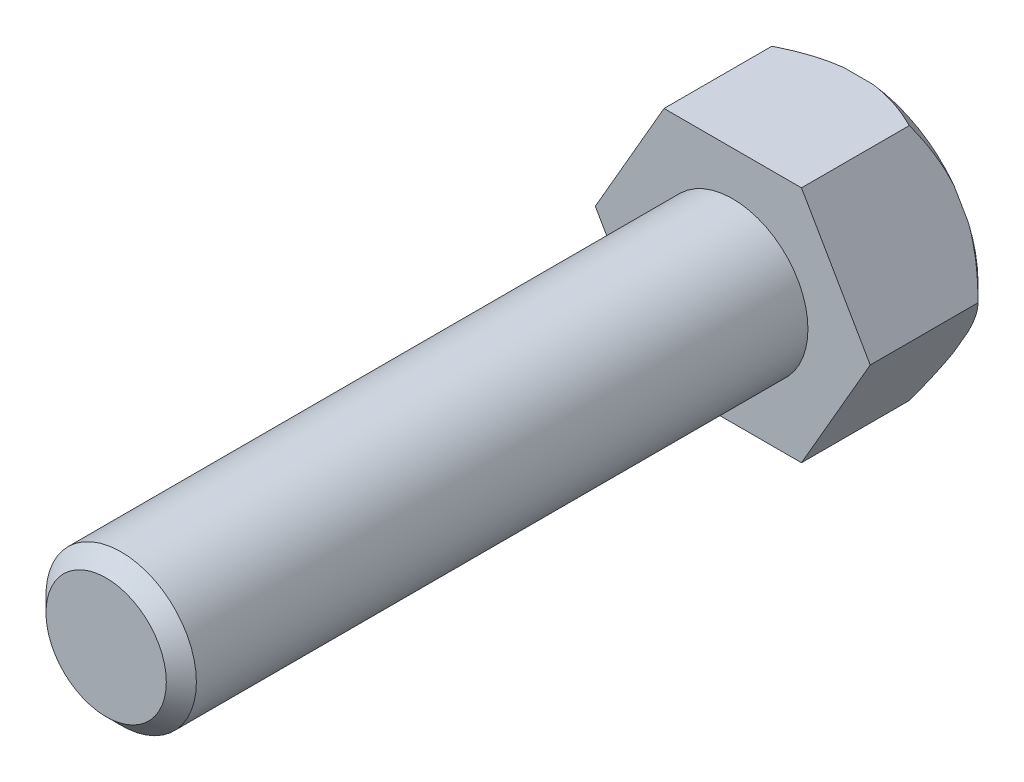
ISO-10303-21;
HEADER;
FILE_DESCRIPTION(('STEP AP214'),'2;1');
FILE_NAME('part.step','',(''),(''),'','','');
FILE_SCHEMA(('AUTOMOTIVE_DESIGN { 1 0 10303 214 1 1 1 1 }'));
ENDSEC;
DATA;
#1=APPLICATION_CONTEXT('core data for automotive mechanical design processes');
#2=APPLICATION_PROTOCOL_DEFINITION('international standard','automotive_design',2000,#1);
#3=PRODUCT_CONTEXT('',#1,'mechanical');
#4=PRODUCT('Part','Part','',(#3));
#5=PRODUCT_RELATED_PRODUCT_CATEGORY('part','',(#4));
#6=PRODUCT_DEFINITION_FORMATION('','',#4);
#7=PRODUCT_DEFINITION_CONTEXT('part definition',#1,'design');
#8=PRODUCT_DEFINITION('design','',#6,#7);
#9=PRODUCT_DEFINITION_SHAPE('','',#8);
#10=(LENGTH_UNIT() NAMED_UNIT(*) SI_UNIT(.MILLI.,.METRE.));
#11=(NAMED_UNIT(*) PLANE_ANGLE_UNIT() SI_UNIT($,.RADIAN.));
#12=(NAMED_UNIT(*) SI_UNIT($,.STERADIAN.) SOLID_ANGLE_UNIT());
#13=UNCERTAINTY_MEASURE_WITH_UNIT(LENGTH_MEASURE(1.E-05),#10,'distance_accuracy_value','');
#14=(GEOMETRIC_REPRESENTATION_CONTEXT(3) GLOBAL_UNCERTAINTY_ASSIGNED_CONTEXT((#13)) GLOBAL_UNIT_ASSIGNED_CONTEXT((#10,
#11,#12)) REPRESENTATION_CONTEXT('',''));
#15=CARTESIAN_POINT('',(0.,0.,0.));
#16=DIRECTION('',(0.,0.,1.));
#17=DIRECTION('',(1.,0.,0.));
#18=AXIS2_PLACEMENT_3D('',#15,#16,#17);
#19=CARTESIAN_POINT('',(5.48482755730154,-9.4999999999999,10.));
#20=DIRECTION('',(-0.866025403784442,0.499999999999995,0.));
#21=DIRECTION('',(-0.499999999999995,-0.866025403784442,0.));
#22=AXIS2_PLACEMENT_3D('',#19,#20,#21);
#23=PLANE('',#22);
#24=CARTESIAN_POINT('',(14.8005929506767,6.63537897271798,6.65026491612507));
#25=CARTESIAN_POINT('',(14.6706409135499,6.41029544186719,6.43963002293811));
#26=CARTESIAN_POINT('',(14.5401736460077,6.1843195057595,6.2302551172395));
#27=CARTESIAN_POINT('',(14.2780302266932,5.7302737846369,5.81450763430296));
#28=CARTESIAN_POINT('',(14.146353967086,5.50220381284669,5.60813532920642));
#29=CARTESIAN_POINT('',(13.8813245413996,5.04315938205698,5.19842974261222));
#30=CARTESIAN_POINT('',(13.7479681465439,4.81217933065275,4.99510480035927));
#31=CARTESIAN_POINT('',(13.4796828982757,4.34749564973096,4.59265629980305));
#32=CARTESIAN_POINT('',(13.3447540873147,4.11379209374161,4.39353262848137));
#33=CARTESIAN_POINT('',(13.0693308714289,3.6367450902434,3.99486470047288));
#34=CARTESIAN_POINT('',(12.9287856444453,3.39331361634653,3.79546054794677));
#35=CARTESIAN_POINT('',(12.6454767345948,2.90260819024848,3.40306375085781));
#36=CARTESIAN_POINT('',(12.502713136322,2.6553343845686,3.2100708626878));
#37=CARTESIAN_POINT('',(12.2147280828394,2.15652964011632,2.83207906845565));
#38=CARTESIAN_POINT('',(12.0695088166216,1.90500249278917,2.6470735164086));
#39=CARTESIAN_POINT('',(11.7761091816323,1.39681941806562,2.28674495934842));
#40=CARTESIAN_POINT('',(11.6279291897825,1.14016414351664,2.11142073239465));
#41=CARTESIAN_POINT('',(11.3243055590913,0.614272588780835,1.76845857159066));
#42=CARTESIAN_POINT('',(11.1687730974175,0.344882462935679,1.60113307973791));
#43=CARTESIAN_POINT('',(10.8536153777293,-0.20098671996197,1.28241527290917));
#44=CARTESIAN_POINT('',(10.6939895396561,-0.47746678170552,1.1310252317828));
#45=CARTESIAN_POINT('',(10.3711673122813,-1.03661128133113,0.849164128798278));
#46=CARTESIAN_POINT('',(10.2079948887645,-1.31923420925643,0.718584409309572));
#47=CARTESIAN_POINT('',(9.87716875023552,-1.89224188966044,0.482394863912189));
#48=CARTESIAN_POINT('',(9.70951640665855,-2.18262426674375,0.376777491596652));
#49=CARTESIAN_POINT('',(9.40334887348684,-2.7129219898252,0.213683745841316));
#50=CARTESIAN_POINT('',(9.26555372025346,-2.95159019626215,0.150830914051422));
#51=CARTESIAN_POINT('',(8.98786817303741,-3.43255567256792,0.0475094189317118));
#52=CARTESIAN_POINT('',(8.84797808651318,-3.6748524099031,0.00703750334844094));
#53=CARTESIAN_POINT('',(8.56720106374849,-4.16117247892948,-0.0494435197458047));
#54=CARTESIAN_POINT('',(8.42631632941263,-4.40519199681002,-0.0654957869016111));
#55=CARTESIAN_POINT('',(8.14438832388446,-4.89350562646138,-0.0723926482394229));
#56=CARTESIAN_POINT('',(8.00334505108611,-5.13779974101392,-0.063236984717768));
#57=CARTESIAN_POINT('',(7.72257782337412,-5.62410284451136,-0.0202815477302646));
#58=CARTESIAN_POINT('',(7.58285141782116,-5.86611607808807,0.0134551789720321));
#59=CARTESIAN_POINT('',(7.30527125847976,-6.34689901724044,0.103764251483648));
#60=CARTESIAN_POINT('',(7.16741766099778,-6.58566845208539,0.160338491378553));
#61=CARTESIAN_POINT('',(6.89380590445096,-7.05957791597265,0.293991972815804));
#62=CARTESIAN_POINT('',(6.75805536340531,-7.29470475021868,0.371132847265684));
#63=CARTESIAN_POINT('',(6.48940478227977,-7.76002120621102,0.542984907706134));
#64=CARTESIAN_POINT('',(6.35650460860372,-7.99021105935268,0.637695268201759));
#65=CARTESIAN_POINT('',(6.04690107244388,-8.52646011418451,0.878198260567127));
#66=CARTESIAN_POINT('',(5.8714055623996,-8.83042725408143,1.03018626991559));
#67=CARTESIAN_POINT('',(5.52536658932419,-9.429784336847,1.35541332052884));
#68=CARTESIAN_POINT('',(5.35482594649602,-9.72516939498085,1.52866418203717));
#69=CARTESIAN_POINT('',(5.01786860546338,-10.3087966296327,1.89200313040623));
#70=CARTESIAN_POINT('',(4.85146115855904,-10.5970227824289,2.08212527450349));
#71=CARTESIAN_POINT('',(4.52255623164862,-11.1667028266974,2.47522996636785));
#72=CARTESIAN_POINT('',(4.36005804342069,-11.4481579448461,2.67821016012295));
#73=CARTESIAN_POINT('',(4.03761751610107,-12.006641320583,3.09529884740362));
#74=CARTESIAN_POINT('',(3.87769053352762,-12.2836429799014,3.30945460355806));
#75=CARTESIAN_POINT('',(3.5606544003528,-12.8327656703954,3.74594758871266));
#76=CARTESIAN_POINT('',(3.40354535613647,-13.1048865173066,3.96828512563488));
#77=CARTESIAN_POINT('',(3.09188244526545,-13.6447025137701,4.4193204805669));
#78=CARTESIAN_POINT('',(2.937326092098,-13.9124019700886,4.64801144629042));
#79=CARTESIAN_POINT('',(2.63024664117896,-14.4442791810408,5.11076186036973));
#80=CARTESIAN_POINT('',(2.47772348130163,-14.7084570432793,5.34482114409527));
#81=CARTESIAN_POINT('',(2.2694860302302,-15.0691348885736,5.66925485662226));
#82=CARTESIAN_POINT('',(2.2130245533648,-15.1669290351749,5.75771895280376));
#83=CARTESIAN_POINT('',(2.10032625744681,-15.3621282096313,5.93523203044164));
#84=CARTESIAN_POINT('',(2.04408945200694,-15.4595332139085,6.02428104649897));
#85=CARTESIAN_POINT('',(1.9320743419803,-15.6535490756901,6.20253325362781));
#86=CARTESIAN_POINT('',(1.87629510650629,-15.7501615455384,6.29173410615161));
#87=CARTESIAN_POINT('',(1.76494207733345,-15.9430306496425,6.47063335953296));
#88=CARTESIAN_POINT('',(1.70936827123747,-16.0392873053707,6.56033172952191));
#89=CARTESIAN_POINT('',(1.65388972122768,-16.1353789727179,6.65026491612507));
#90=B_SPLINE_CURVE_WITH_KNOTS('',3,(#24,#25,#26,#27,#28,#29,#30,#31,#32,#33,#34,#35,#36,#37,#38,
#39,#40,#41,#42,#43,#44,#45,#46,#47,#48,#49,#50,#51,#52,#53,#54,#55,#56,#57,#58,#59,#60,#61,#62,
#63,#64,#65,#66,#67,#68,#69,#70,#71,#72,#73,#74,#75,#76,#77,#78,#79,#80,#81,#82,#83,#84,#85,#86,
#87,#88,#89),.UNSPECIFIED.,.F.,.F.,(4,2,2,2,2,2,2,2,2,2,2,2,2,2,2,2,2,2,2,2,2,2,2,2,2,2,2,2,2,2,
2,2,4),(0.,1.00362759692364,2.00734559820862,3.01343680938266,4.01950092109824,5.05333505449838,
6.08712986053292,7.12004721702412,8.15283390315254,9.21210777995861,10.2715326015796,
11.3252305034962,12.3786094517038,13.225803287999,14.0728739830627,14.9184458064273,
15.7640262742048,16.6074455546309,17.4509348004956,18.2969807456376,19.1429869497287,
20.289479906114,21.4366131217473,22.5861170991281,23.7354112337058,24.8900377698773,
26.0447078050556,27.1981774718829,28.3516118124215,28.7819564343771,29.2123267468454,
29.640832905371,30.069312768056),.UNSPECIFIED.);
#91=CARTESIAN_POINT('',(10.9696551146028,0.,1.4));
#92=VERTEX_POINT('',#91);
#93=CARTESIAN_POINT('',(8.80350061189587,-3.75188965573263,0.));
#94=VERTEX_POINT('',#93);
#95=EDGE_CURVE('E274',#92,#94,#90,.T.);
#96=ORIENTED_EDGE('',*,*,#95,.F.);
#97=DIRECTION('',(0.,0.,-1.));
#98=VECTOR('',#97,1.);
#99=CARTESIAN_POINT('',(10.9696551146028,0.,10.));
#100=LINE('',#99,#98);
#101=CARTESIAN_POINT('',(10.9696551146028,0.,10.));
#102=VERTEX_POINT('',#101);
#103=EDGE_CURVE('E163',#102,#92,#100,.T.);
#104=ORIENTED_EDGE('',*,*,#103,.F.);
#105=DIRECTION('',(0.499999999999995,0.866025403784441,0.));
#106=VECTOR('',#105,1.);
#107=CARTESIAN_POINT('',(5.48482755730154,-9.4999999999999,10.));
#108=LINE('',#107,#106);
#109=CARTESIAN_POINT('',(5.48482755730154,-9.4999999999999,10.));
#110=VERTEX_POINT('',#109);
#111=EDGE_CURVE('E199',#110,#102,#108,.T.);
#112=ORIENTED_EDGE('',*,*,#111,.F.);
#113=DIRECTION('',(0.,0.,-1.));
#114=VECTOR('',#113,1.);
#115=CARTESIAN_POINT('',(5.48482755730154,-9.4999999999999,10.));
#116=LINE('',#115,#114);
#117=CARTESIAN_POINT('',(5.48482755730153,-9.4999999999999,1.4));
#118=VERTEX_POINT('',#117);
#119=EDGE_CURVE('E157',#110,#118,#116,.T.);
#120=ORIENTED_EDGE('',*,*,#119,.T.);
#121=CARTESIAN_POINT('',(7.65098206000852,-5.74811034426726,0.));
#122=VERTEX_POINT('',#121);
#123=EDGE_CURVE('E131',#122,#118,#90,.T.);
#124=ORIENTED_EDGE('',*,*,#123,.F.);
#125=DIRECTION('',(0.499999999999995,0.866025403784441,0.));
#126=VECTOR('',#125,1.);
#127=CARTESIAN_POINT('',(5.48482755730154,-9.4999999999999,0.));
#128=LINE('',#127,#126);
#129=EDGE_CURVE('E213',#122,#94,#128,.T.);
#130=ORIENTED_EDGE('',*,*,#129,.T.);
#131=EDGE_LOOP('',(#96,#104,#112,#120,#124,#130));
#132=FACE_BOUND('',#131,.T.);
#133=ADVANCED_FACE('F33',(#132),#23,.F.);
#134=CARTESIAN_POINT('',(10.9696551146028,0.,10.));
#135=DIRECTION('',(-0.866025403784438,-0.500000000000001,0.));
#136=DIRECTION('',(0.500000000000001,-0.866025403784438,0.));
#137=AXIS2_PLACEMENT_3D('',#134,#135,#136);
#138=PLANE('',#137);
#139=CARTESIAN_POINT('',(1.65388972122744,16.135378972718,6.6502649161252));
#140=CARTESIAN_POINT('',(1.78384175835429,15.9102954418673,6.43963002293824));
#141=CARTESIAN_POINT('',(1.91430902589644,15.6843195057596,6.23025511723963));
#142=CARTESIAN_POINT('',(2.17645244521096,15.230273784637,5.8145076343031));
#143=CARTESIAN_POINT('',(2.30812870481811,15.0022038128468,5.60813532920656));
#144=CARTESIAN_POINT('',(2.57315813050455,14.5431593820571,5.19842974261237));
#145=CARTESIAN_POINT('',(2.70651452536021,14.3121793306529,4.99510480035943));
#146=CARTESIAN_POINT('',(2.97479977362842,13.8474956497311,4.5926562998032));
#147=CARTESIAN_POINT('',(3.10972858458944,13.6137920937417,4.39353262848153));
#148=CARTESIAN_POINT('',(3.38515180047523,13.1367450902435,3.99486470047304));
#149=CARTESIAN_POINT('',(3.52569702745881,12.8933136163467,3.79546054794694));
#150=CARTESIAN_POINT('',(3.80900593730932,12.4026081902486,3.40306375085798));
#151=CARTESIAN_POINT('',(3.95176953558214,12.1553343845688,3.21007086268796));
#152=CARTESIAN_POINT('',(4.23975458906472,11.6565296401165,2.83207906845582));
#153=CARTESIAN_POINT('',(4.38497385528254,11.4050024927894,2.64707351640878));
#154=CARTESIAN_POINT('',(4.67837349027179,10.8968194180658,2.28674495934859));
#155=CARTESIAN_POINT('',(4.82655348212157,10.6401641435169,2.11142073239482));
#156=CARTESIAN_POINT('',(5.13017711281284,10.1142725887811,1.76845857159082));
#157=CARTESIAN_POINT('',(5.28570957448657,9.84488246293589,1.60113307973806));
#158=CARTESIAN_POINT('',(5.60086729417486,9.29901328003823,1.2824152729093));
#159=CARTESIAN_POINT('',(5.76049313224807,9.02253321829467,1.13102523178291));
#160=CARTESIAN_POINT('',(6.08331535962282,8.46338871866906,0.849164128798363));
#161=CARTESIAN_POINT('',(6.24648778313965,8.18076579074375,0.718584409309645));
#162=CARTESIAN_POINT('',(6.57731392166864,7.60775811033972,0.48239486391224));
#163=CARTESIAN_POINT('',(6.74496626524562,7.31737573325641,0.376777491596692));
#164=CARTESIAN_POINT('',(7.05113379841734,6.78707801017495,0.213683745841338));
#165=CARTESIAN_POINT('',(7.18892895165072,6.548409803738,0.150830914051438));
#166=CARTESIAN_POINT('',(7.46661449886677,6.06744432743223,0.0475094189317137));
#167=CARTESIAN_POINT('',(7.60650458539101,5.82514759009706,0.00703750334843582));
#168=CARTESIAN_POINT('',(7.88728160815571,5.33882752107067,-0.0494435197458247));
#169=CARTESIAN_POINT('',(8.02816634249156,5.09480800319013,-0.0654957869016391));
#170=CARTESIAN_POINT('',(8.31009434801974,4.60649437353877,-0.0723926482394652));
#171=CARTESIAN_POINT('',(8.45113762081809,4.36220025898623,-0.0632369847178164));
#172=CARTESIAN_POINT('',(8.73190484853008,3.8758971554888,-0.020281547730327));
#173=CARTESIAN_POINT('',(8.87163125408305,3.63388392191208,0.0134551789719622));
#174=CARTESIAN_POINT('',(9.14921141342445,3.15310098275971,0.103764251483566));
#175=CARTESIAN_POINT('',(9.28706501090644,2.91433154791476,0.160338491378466));
#176=CARTESIAN_POINT('',(9.56067676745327,2.44042208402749,0.293991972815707));
#177=CARTESIAN_POINT('',(9.69642730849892,2.20529524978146,0.371132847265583));
#178=CARTESIAN_POINT('',(9.96507788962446,1.73997879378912,0.542984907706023));
#179=CARTESIAN_POINT('',(10.0979780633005,1.50978894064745,0.637695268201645));
#180=CARTESIAN_POINT('',(10.4075815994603,0.973539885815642,0.878198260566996));
#181=CARTESIAN_POINT('',(10.5830771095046,0.669572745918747,1.03018626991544));
#182=CARTESIAN_POINT('',(10.92911608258,0.0702156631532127,1.35541332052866));
#183=CARTESIAN_POINT('',(11.0996567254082,-0.225169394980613,1.52866418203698));
#184=CARTESIAN_POINT('',(11.4366140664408,-0.808796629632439,1.892003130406));
#185=CARTESIAN_POINT('',(11.6030215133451,-1.09702278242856,2.08212527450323));
#186=CARTESIAN_POINT('',(11.9319264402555,-1.6667028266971,2.47522996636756));
#187=CARTESIAN_POINT('',(12.0944246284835,-1.94815794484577,2.67821016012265));
#188=CARTESIAN_POINT('',(12.4168651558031,-2.50664132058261,3.09529884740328));
#189=CARTESIAN_POINT('',(12.5767921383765,-2.783642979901,3.3094546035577));
#190=CARTESIAN_POINT('',(12.8938282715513,-3.33276567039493,3.74594758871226));
#191=CARTESIAN_POINT('',(13.0509373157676,-3.60488651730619,3.96828512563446));
#192=CARTESIAN_POINT('',(13.3626002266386,-4.14470251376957,4.41932048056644));
#193=CARTESIAN_POINT('',(13.5171565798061,-4.41240197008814,4.64801144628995));
#194=CARTESIAN_POINT('',(13.8242360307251,-4.94427918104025,5.11076186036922));
#195=CARTESIAN_POINT('',(13.9767591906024,-5.20845704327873,5.34482114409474));
#196=CARTESIAN_POINT('',(14.1849966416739,-5.56913488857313,5.66925485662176));
#197=CARTESIAN_POINT('',(14.2414581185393,-5.66692903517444,5.75771895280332));
#198=CARTESIAN_POINT('',(14.3541564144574,-5.86212820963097,5.93523203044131));
#199=CARTESIAN_POINT('',(14.4103932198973,-5.95953321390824,6.02428104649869));
#200=CARTESIAN_POINT('',(14.522408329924,-6.15354907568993,6.20253325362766));
#201=CARTESIAN_POINT('',(14.5781875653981,-6.25016154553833,6.29173410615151));
#202=CARTESIAN_POINT('',(14.689540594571,-6.44303064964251,6.47063335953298));
#203=CARTESIAN_POINT('',(14.745114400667,-6.53928730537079,6.56033172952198));
#204=CARTESIAN_POINT('',(14.8005929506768,-6.63537897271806,6.6502649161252));
#205=B_SPLINE_CURVE_WITH_KNOTS('',3,(#139,#140,#141,#142,#143,#144,#145,#146,#147,#148,#149,
#150,#151,#152,#153,#154,#155,#156,#157,#158,#159,#160,#161,#162,#163,#164,#165,#166,#167,#168,
#169,#170,#171,#172,#173,#174,#175,#176,#177,#178,#179,#180,#181,#182,#183,#184,#185,#186,#187,
#188,#189,#190,#191,#192,#193,#194,#195,#196,#197,#198,#199,#200,#201,#202,#203,#204),
.UNSPECIFIED.,.F.,.F.,(4,2,2,2,2,2,2,2,2,2,2,2,2,2,2,2,2,2,2,2,2,2,2,2,2,2,2,2,2,2,2,2,4),(0.,
1.00362759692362,2.00734559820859,3.01343680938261,4.01950092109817,5.05333505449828,
6.0871298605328,7.12004721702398,8.15283390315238,9.21210777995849,10.2715326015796,
11.3252305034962,12.3786094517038,13.225803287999,14.0728739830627,14.9184458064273,
15.7640262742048,16.6074455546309,17.4509348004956,18.2969807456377,19.1429869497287,
20.289479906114,21.4366131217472,22.5861170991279,23.7354112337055,24.8900377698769,
26.0447078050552,27.1981774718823,28.3516118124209,28.7819564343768,29.2123267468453,
29.6408329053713,30.0693127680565),.UNSPECIFIED.);
#206=CARTESIAN_POINT('',(5.48482755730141,9.49999999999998,1.4));
#207=VERTEX_POINT('',#206);
#208=CARTESIAN_POINT('',(7.65098206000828,5.74811034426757,0.));
#209=VERTEX_POINT('',#208);
#210=EDGE_CURVE('E48',#207,#209,#205,.T.);
#211=ORIENTED_EDGE('',*,*,#210,.F.);
#212=DIRECTION('',(0.,0.,-1.));
#213=VECTOR('',#212,1.);
#214=CARTESIAN_POINT('',(5.4848275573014,9.49999999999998,10.));
#215=LINE('',#214,#213);
#216=CARTESIAN_POINT('',(5.4848275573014,9.49999999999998,10.));
#217=VERTEX_POINT('',#216);
#218=EDGE_CURVE('E154',#217,#207,#215,.T.);
#219=ORIENTED_EDGE('',*,*,#218,.F.);
#220=DIRECTION('',(-0.500000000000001,0.866025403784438,0.));
#221=VECTOR('',#220,1.);
#222=CARTESIAN_POINT('',(10.9696551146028,0.,10.));
#223=LINE('',#222,#221);
#224=EDGE_CURVE('E311',#102,#217,#223,.T.);
#225=ORIENTED_EDGE('',*,*,#224,.F.);
#226=ORIENTED_EDGE('',*,*,#103,.T.);
#227=CARTESIAN_POINT('',(8.80350061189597,3.7518896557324,0.));
#228=VERTEX_POINT('',#227);
#229=EDGE_CURVE('E221',#228,#92,#205,.T.);
#230=ORIENTED_EDGE('',*,*,#229,.F.);
#231=DIRECTION('',(-0.500000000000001,0.866025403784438,0.));
#232=VECTOR('',#231,1.);
#233=CARTESIAN_POINT('',(10.9696551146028,0.,0.));
#234=LINE('',#233,#232);
#235=EDGE_CURVE('E194',#228,#209,#234,.T.);
#236=ORIENTED_EDGE('',*,*,#235,.T.);
#237=EDGE_LOOP('',(#211,#219,#225,#226,#230,#236));
#238=FACE_BOUND('',#237,.T.);
#239=ADVANCED_FACE('F219',(#238),#138,.F.);
#240=CARTESIAN_POINT('',(5.4848275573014,9.49999999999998,10.));
#241=DIRECTION('',(0.,-1.,0.));
#242=DIRECTION('',(1.,0.,0.));
#243=AXIS2_PLACEMENT_3D('',#240,#241,#242);
#244=PLANE('',#243);
#245=CARTESIAN_POINT('',(-12.1202065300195,9.49999999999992,5.83000093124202));
#246=CARTESIAN_POINT('',(-11.8487091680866,9.49999999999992,5.61635839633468));
#247=CARTESIAN_POINT('',(-11.5759092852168,9.49999999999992,5.40434993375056));
#248=CARTESIAN_POINT('',(-11.0272008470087,9.49999999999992,4.98430264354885));
#249=CARTESIAN_POINT('',(-10.7512917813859,9.49999999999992,4.77626448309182));
#250=CARTESIAN_POINT('',(-10.1945523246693,9.49999999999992,4.3638946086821));
#251=CARTESIAN_POINT('',(-9.91370414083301,9.49999999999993,4.15958685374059));
#252=CARTESIAN_POINT('',(-9.34789210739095,9.49999999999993,3.75676942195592));
#253=CARTESIAN_POINT('',(-9.06292846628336,9.49999999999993,3.55825945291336));
#254=CARTESIAN_POINT('',(-8.47401878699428,9.49999999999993,3.15865602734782));
#255=CARTESIAN_POINT('',(-8.16983011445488,9.49999999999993,2.95791879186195));
#256=CARTESIAN_POINT('',(-7.55524331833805,9.49999999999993,2.56606221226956));
#257=CARTESIAN_POINT('',(-7.24484450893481,9.49999999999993,2.37494393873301));
#258=CARTESIAN_POINT('',(-6.61748237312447,9.49999999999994,2.00518686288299));
#259=CARTESIAN_POINT('',(-6.30053316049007,9.49999999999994,1.82652425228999));
#260=CARTESIAN_POINT('',(-5.65851794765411,9.49999999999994,1.4845308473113));
#261=CARTESIAN_POINT('',(-5.33345445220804,9.49999999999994,1.32119539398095));
#262=CARTESIAN_POINT('',(-4.70826893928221,9.49999999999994,1.02984776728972));
#263=CARTESIAN_POINT('',(-4.40904176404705,9.49999999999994,0.899929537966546));
#264=CARTESIAN_POINT('',(-3.8027977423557,9.49999999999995,0.659414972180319));
#265=CARTESIAN_POINT('',(-3.49578015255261,9.49999999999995,0.548820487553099));
#266=CARTESIAN_POINT('',(-2.87770941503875,9.49999999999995,0.352362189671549));
#267=CARTESIAN_POINT('',(-2.56674304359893,9.49999999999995,0.266229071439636));
#268=CARTESIAN_POINT('',(-1.93844426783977,9.49999999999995,0.121281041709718));
#269=CARTESIAN_POINT('',(-1.62111268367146,9.49999999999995,0.0624626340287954));
#270=CARTESIAN_POINT('',(-0.976212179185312,9.49999999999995,-0.0250665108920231));
#271=CARTESIAN_POINT('',(-0.648562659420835,9.49999999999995,-0.0531962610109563));
#272=CARTESIAN_POINT('',(0.0078798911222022,9.49999999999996,-0.0753150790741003));
#273=CARTESIAN_POINT('',(0.336672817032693,9.49999999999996,-0.0693071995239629));
#274=CARTESIAN_POINT('',(0.992848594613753,9.49999999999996,-0.0235433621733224));
#275=CARTESIAN_POINT('',(1.32022423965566,9.49999999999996,0.0163139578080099));
#276=CARTESIAN_POINT('',(1.96964494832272,9.49999999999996,0.127094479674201));
#277=CARTESIAN_POINT('',(2.29168855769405,9.49999999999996,0.198026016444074));
#278=CARTESIAN_POINT('',(3.02649758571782,9.49999999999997,0.392695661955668));
#279=CARTESIAN_POINT('',(3.43671743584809,9.49999999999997,0.525964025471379));
#280=CARTESIAN_POINT('',(4.24365047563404,9.49999999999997,0.828335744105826));
#281=CARTESIAN_POINT('',(4.64035542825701,9.49999999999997,0.997460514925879));
#282=CARTESIAN_POINT('',(5.42379206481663,9.49999999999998,1.36409106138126));
#283=CARTESIAN_POINT('',(5.81042952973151,9.49999999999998,1.56179545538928));
#284=CARTESIAN_POINT('',(6.57224047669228,9.49999999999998,1.97775046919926));
#285=CARTESIAN_POINT('',(6.94741659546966,9.49999999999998,2.19599631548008));
#286=CARTESIAN_POINT('',(7.74169759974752,9.49999999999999,2.68069359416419));
#287=CARTESIAN_POINT('',(8.15932182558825,9.49999999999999,2.94955495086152));
#288=CARTESIAN_POINT('',(8.98451853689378,9.49999999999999,3.50236891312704));
#289=CARTESIAN_POINT('',(9.3920887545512,9.49999999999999,3.7863248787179));
#290=CARTESIAN_POINT('',(9.99278151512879,9.49999999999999,4.21754710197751));
#291=CARTESIAN_POINT('',(10.1890310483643,9.49999999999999,4.36049166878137));
#292=CARTESIAN_POINT('',(10.5797628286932,9.49999999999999,4.64878242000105));
#293=CARTESIAN_POINT('',(10.7742450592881,9.5,4.79412862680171));
#294=CARTESIAN_POINT('',(11.1614746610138,9.5,5.08682647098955));
#295=CARTESIAN_POINT('',(11.3542231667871,9.5,5.23417660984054));
#296=CARTESIAN_POINT('',(11.7382662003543,9.5,5.53074472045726));
#297=CARTESIAN_POINT('',(11.9295607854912,9.5,5.67996261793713));
#298=CARTESIAN_POINT('',(12.1202065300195,9.5,5.83000093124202));
#299=B_SPLINE_CURVE_WITH_KNOTS('',3,(#245,#246,#247,#248,#249,#250,#251,#252,#253,#254,#255,
#256,#257,#258,#259,#260,#261,#262,#263,#264,#265,#266,#267,#268,#269,#270,#271,#272,#273,#274,
#275,#276,#277,#278,#279,#280,#281,#282,#283,#284,#285,#286,#287,#288,#289,#290,#291,#292,#293,
#294,#295,#296,#297,#298),.UNSPECIFIED.,.F.,.F.,(4,2,2,2,2,2,2,2,2,2,2,2,2,2,2,2,2,2,2,2,2,2,2,
2,2,2,4),(0.,1.03644238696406,2.07305742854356,3.11489594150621,4.15668185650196,
5.24989585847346,6.34323126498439,7.43441602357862,8.52526801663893,9.5033683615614,
10.4815623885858,11.4485279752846,12.4153697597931,13.4002138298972,14.3849698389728,
15.3726851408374,16.3606655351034,17.6523696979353,18.9448475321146,20.2467828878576,
21.5484164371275,23.0380269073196,24.5279703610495,25.2563269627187,25.9846903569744,
26.7125361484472,27.4403530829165),.UNSPECIFIED.);
#300=CARTESIAN_POINT('',(-5.48482755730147,9.49999999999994,1.4));
#301=VERTEX_POINT('',#300);
#302=CARTESIAN_POINT('',(-1.15251855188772,9.49999999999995,0.));
#303=VERTEX_POINT('',#302);
#304=EDGE_CURVE('E56',#301,#303,#299,.T.);
#305=ORIENTED_EDGE('',*,*,#304,.F.);
#306=DIRECTION('',(0.,0.,-1.));
#307=VECTOR('',#306,1.);
#308=CARTESIAN_POINT('',(-5.48482755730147,9.49999999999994,10.));
#309=LINE('',#308,#307);
#310=CARTESIAN_POINT('',(-5.48482755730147,9.49999999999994,10.));
#311=VERTEX_POINT('',#310);
#312=EDGE_CURVE('E150',#311,#301,#309,.T.);
#313=ORIENTED_EDGE('',*,*,#312,.F.);
#314=DIRECTION('',(-1.,0.,0.));
#315=VECTOR('',#314,1.);
#316=CARTESIAN_POINT('',(5.4848275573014,9.49999999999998,10.));
#317=LINE('',#316,#315);
#318=EDGE_CURVE('E313',#217,#311,#317,.T.);
#319=ORIENTED_EDGE('',*,*,#318,.F.);
#320=ORIENTED_EDGE('',*,*,#218,.T.);
#321=CARTESIAN_POINT('',(1.15251855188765,9.49999999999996,0.));
#322=VERTEX_POINT('',#321);
#323=EDGE_CURVE('E225',#322,#207,#299,.T.);
#324=ORIENTED_EDGE('',*,*,#323,.F.);
#325=DIRECTION('',(-1.,0.,0.));
#326=VECTOR('',#325,1.);
#327=CARTESIAN_POINT('',(5.4848275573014,9.49999999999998,0.));
#328=LINE('',#327,#326);
#329=EDGE_CURVE('E190',#322,#303,#328,.T.);
#330=ORIENTED_EDGE('',*,*,#329,.T.);
#331=EDGE_LOOP('',(#305,#313,#319,#320,#324,#330));
#332=FACE_BOUND('',#331,.T.);
#333=ADVANCED_FACE('F227',(#332),#244,.F.);
#334=CARTESIAN_POINT('',(-5.48482755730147,9.49999999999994,10.));
#335=DIRECTION('',(0.866025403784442,-0.499999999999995,0.));
#336=DIRECTION('',(0.499999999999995,0.866025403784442,0.));
#337=AXIS2_PLACEMENT_3D('',#334,#335,#336);
#338=PLANE('',#337);
#339=CARTESIAN_POINT('',(-14.8005929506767,-6.63537897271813,6.65026491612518));
#340=CARTESIAN_POINT('',(-14.6706409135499,-6.41029544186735,6.43963002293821));
#341=CARTESIAN_POINT('',(-14.5401736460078,-6.18431950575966,6.23025511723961));
#342=CARTESIAN_POINT('',(-14.2780302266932,-5.73027378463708,5.81450763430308));
#343=CARTESIAN_POINT('',(-14.1463539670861,-5.50220381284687,5.60813532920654));
#344=CARTESIAN_POINT('',(-13.8813245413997,-5.04315938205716,5.19842974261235));
#345=CARTESIAN_POINT('',(-13.747968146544,-4.81217933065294,4.9951048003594));
#346=CARTESIAN_POINT('',(-13.4796828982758,-4.34749564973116,4.59265629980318));
#347=CARTESIAN_POINT('',(-13.3447540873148,-4.11379209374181,4.3935326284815));
#348=CARTESIAN_POINT('',(-13.069330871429,-3.63674509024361,3.99486470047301));
#349=CARTESIAN_POINT('',(-12.9287856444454,-3.39331361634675,3.79546054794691));
#350=CARTESIAN_POINT('',(-12.6454767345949,-2.90260819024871,3.40306375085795));
#351=CARTESIAN_POINT('',(-12.5027131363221,-2.65533438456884,3.21007086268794));
#352=CARTESIAN_POINT('',(-12.2147280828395,-2.15652964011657,2.83207906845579));
#353=CARTESIAN_POINT('',(-12.0695088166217,-1.90500249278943,2.64707351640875));
#354=CARTESIAN_POINT('',(-11.7761091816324,-1.39681941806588,2.28674495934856));
#355=CARTESIAN_POINT('',(-11.6279291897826,-1.14016414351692,2.11142073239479));
#356=CARTESIAN_POINT('',(-11.3243055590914,-0.614272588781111,1.76845857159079));
#357=CARTESIAN_POINT('',(-11.1687730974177,-0.344882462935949,1.60113307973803));
#358=CARTESIAN_POINT('',(-10.8536153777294,0.200986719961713,1.28241527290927));
#359=CARTESIAN_POINT('',(-10.6939895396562,0.477466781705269,1.13102523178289));
#360=CARTESIAN_POINT('',(-10.3711673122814,1.03661128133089,0.849164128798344));
#361=CARTESIAN_POINT('',(-10.2079948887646,1.3192342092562,0.718584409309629));
#362=CARTESIAN_POINT('',(-9.8771687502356,1.89224188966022,0.482394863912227));
#363=CARTESIAN_POINT('',(-9.70951640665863,2.18262426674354,0.376777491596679));
#364=CARTESIAN_POINT('',(-9.40334887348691,2.71292198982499,0.213683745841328));
#365=CARTESIAN_POINT('',(-9.26555372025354,2.95159019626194,0.15083091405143));
#366=CARTESIAN_POINT('',(-8.98786817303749,3.43255567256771,0.0475094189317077));
#367=CARTESIAN_POINT('',(-8.84797808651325,3.67485240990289,0.00703750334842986));
#368=CARTESIAN_POINT('',(-8.56720106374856,4.16117247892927,-0.0494435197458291));
#369=CARTESIAN_POINT('',(-8.42631632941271,4.40519199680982,-0.065495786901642));
#370=CARTESIAN_POINT('',(-8.14438832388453,4.89350562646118,-0.0723926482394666));
#371=CARTESIAN_POINT('',(-8.00334505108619,5.13779974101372,-0.063236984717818));
#372=CARTESIAN_POINT('',(-7.72257782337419,5.62410284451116,-0.0202815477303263));
#373=CARTESIAN_POINT('',(-7.58285141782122,5.86611607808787,0.0134551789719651));
#374=CARTESIAN_POINT('',(-7.30527125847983,6.34689901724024,0.103764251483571));
#375=CARTESIAN_POINT('',(-7.16741766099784,6.58566845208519,0.160338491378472));
#376=CARTESIAN_POINT('',(-6.89380590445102,7.05957791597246,0.293991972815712));
#377=CARTESIAN_POINT('',(-6.75805536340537,7.29470475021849,0.371132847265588));
#378=CARTESIAN_POINT('',(-6.48940478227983,7.76002120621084,0.54298490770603));
#379=CARTESIAN_POINT('',(-6.35650460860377,7.9902110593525,0.637695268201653));
#380=CARTESIAN_POINT('',(-6.04690107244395,8.52646011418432,0.878198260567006));
#381=CARTESIAN_POINT('',(-5.87140556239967,8.83042725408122,1.03018626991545));
#382=CARTESIAN_POINT('',(-5.52536658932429,9.42978433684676,1.35541332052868));
#383=CARTESIAN_POINT('',(-5.35482594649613,9.72516939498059,1.52866418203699));
#384=CARTESIAN_POINT('',(-5.0178686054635,10.3087966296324,1.89200313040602));
#385=CARTESIAN_POINT('',(-4.85146115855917,10.5970227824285,2.08212527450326));
#386=CARTESIAN_POINT('',(-4.52255623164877,11.1667028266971,2.47522996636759));
#387=CARTESIAN_POINT('',(-4.36005804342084,11.4481579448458,2.67821016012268));
#388=CARTESIAN_POINT('',(-4.03761751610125,12.0066413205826,3.09529884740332));
#389=CARTESIAN_POINT('',(-3.8776905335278,12.283642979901,3.30945460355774));
#390=CARTESIAN_POINT('',(-3.560654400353,12.8327656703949,3.7459475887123));
#391=CARTESIAN_POINT('',(-3.40354535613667,13.1048865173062,3.9682851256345));
#392=CARTESIAN_POINT('',(-3.09188244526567,13.6447025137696,4.41932048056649));
#393=CARTESIAN_POINT('',(-2.93732609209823,13.9124019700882,4.64801144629));
#394=CARTESIAN_POINT('',(-2.6302466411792,14.4442791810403,5.11076186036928));
#395=CARTESIAN_POINT('',(-2.47772348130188,14.7084570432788,5.3448211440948));
#396=CARTESIAN_POINT('',(-2.26948603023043,15.0691348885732,5.66925485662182));
#397=CARTESIAN_POINT('',(-2.213024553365,15.1669290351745,5.75771895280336));
#398=CARTESIAN_POINT('',(-2.10032625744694,15.362128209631,5.93523203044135));
#399=CARTESIAN_POINT('',(-2.04408945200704,15.4595332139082,6.02428104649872));
#400=CARTESIAN_POINT('',(-1.93207434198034,15.6535490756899,6.20253325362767));
#401=CARTESIAN_POINT('',(-1.8762951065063,15.7501615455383,6.29173410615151));
#402=CARTESIAN_POINT('',(-1.76494207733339,15.9430306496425,6.47063335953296));
#403=CARTESIAN_POINT('',(-1.70936827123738,16.0392873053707,6.56033172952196));
#404=CARTESIAN_POINT('',(-1.65388972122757,16.135378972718,6.65026491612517));
#405=B_SPLINE_CURVE_WITH_KNOTS('',3,(#339,#340,#341,#342,#343,#344,#345,#346,#347,#348,#349,
#350,#351,#352,#353,#354,#355,#356,#357,#358,#359,#360,#361,#362,#363,#364,#365,#366,#367,#368,
#369,#370,#371,#372,#373,#374,#375,#376,#377,#378,#379,#380,#381,#382,#383,#384,#385,#386,#387,
#388,#389,#390,#391,#392,#393,#394,#395,#396,#397,#398,#399,#400,#401,#402,#403,#404),
.UNSPECIFIED.,.F.,.F.,(4,2,2,2,2,2,2,2,2,2,2,2,2,2,2,2,2,2,2,2,2,2,2,2,2,2,2,2,2,2,2,2,4),(0.,
1.00362759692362,2.00734559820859,3.01343680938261,4.01950092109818,5.0533350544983,
6.08712986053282,7.120047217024,8.15283390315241,9.21210777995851,10.2715326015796,
11.3252305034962,12.3786094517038,13.225803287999,14.0728739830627,14.9184458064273,
15.7640262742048,16.6074455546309,17.4509348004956,18.2969807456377,19.1429869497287,
20.289479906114,21.4366131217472,22.586117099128,23.7354112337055,24.8900377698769,
26.0447078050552,27.1981774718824,28.351611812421,28.7819564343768,29.2123267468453,
29.6408329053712,30.0693127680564),.UNSPECIFIED.);
#406=CARTESIAN_POINT('',(-10.9696551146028,0.,1.4));
#407=VERTEX_POINT('',#406);
#408=CARTESIAN_POINT('',(-8.803500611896,3.75188965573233,0.));
#409=VERTEX_POINT('',#408);
#410=EDGE_CURVE('E124',#407,#409,#405,.T.);
#411=ORIENTED_EDGE('',*,*,#410,.F.);
#412=DIRECTION('',(0.,0.,-1.));
#413=VECTOR('',#412,1.);
#414=CARTESIAN_POINT('',(-10.9696551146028,0.,10.));
#415=LINE('',#414,#413);
#416=CARTESIAN_POINT('',(-10.9696551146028,0.,10.));
#417=VERTEX_POINT('',#416);
#418=EDGE_CURVE('E139',#417,#407,#415,.T.);
#419=ORIENTED_EDGE('',*,*,#418,.F.);
#420=DIRECTION('',(-0.499999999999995,-0.866025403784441,0.));
#421=VECTOR('',#420,1.);
#422=CARTESIAN_POINT('',(-5.48482755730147,9.49999999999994,10.));
#423=LINE('',#422,#421);
#424=EDGE_CURVE('E209',#311,#417,#423,.T.);
#425=ORIENTED_EDGE('',*,*,#424,.F.);
#426=ORIENTED_EDGE('',*,*,#312,.T.);
#427=CARTESIAN_POINT('',(-7.65098206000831,5.74811034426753,0.));
#428=VERTEX_POINT('',#427);
#429=EDGE_CURVE('E144',#428,#301,#405,.T.);
#430=ORIENTED_EDGE('',*,*,#429,.F.);
#431=DIRECTION('',(-0.499999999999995,-0.866025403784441,0.));
#432=VECTOR('',#431,1.);
#433=CARTESIAN_POINT('',(-5.48482755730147,9.49999999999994,0.));
#434=LINE('',#433,#432);
#435=EDGE_CURVE('E143',#428,#409,#434,.T.);
#436=ORIENTED_EDGE('',*,*,#435,.T.);
#437=EDGE_LOOP('',(#411,#419,#425,#426,#430,#436));
#438=FACE_BOUND('',#437,.T.);
#439=ADVANCED_FACE('F137',(#438),#338,.F.);
#440=CARTESIAN_POINT('',(-10.9696551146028,0.,10.));
#441=DIRECTION('',(0.866025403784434,0.500000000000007,0.));
#442=DIRECTION('',(-0.500000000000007,0.866025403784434,0.));
#443=AXIS2_PLACEMENT_3D('',#440,#441,#442);
#444=PLANE('',#443);
#445=CARTESIAN_POINT('',(-1.65388972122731,-16.1353789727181,6.65026491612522));
#446=CARTESIAN_POINT('',(-1.78384175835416,-15.9102954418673,6.43963002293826));
#447=CARTESIAN_POINT('',(-1.91430902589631,-15.6843195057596,6.23025511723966));
#448=CARTESIAN_POINT('',(-2.17645244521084,-15.230273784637,5.81450763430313));
#449=CARTESIAN_POINT('',(-2.30812870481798,-15.0022038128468,5.60813532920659));
#450=CARTESIAN_POINT('',(-2.57315813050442,-14.5431593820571,5.1984297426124));
#451=CARTESIAN_POINT('',(-2.70651452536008,-14.3121793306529,4.99510480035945));
#452=CARTESIAN_POINT('',(-2.9747997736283,-13.8474956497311,4.59265629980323));
#453=CARTESIAN_POINT('',(-3.10972858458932,-13.6137920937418,4.39353262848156));
#454=CARTESIAN_POINT('',(-3.38515180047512,-13.1367450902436,3.99486470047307));
#455=CARTESIAN_POINT('',(-3.5256970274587,-12.8933136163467,3.79546054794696));
#456=CARTESIAN_POINT('',(-3.80900593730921,-12.4026081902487,3.40306375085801));
#457=CARTESIAN_POINT('',(-3.95176953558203,-12.1553343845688,3.21007086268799));
#458=CARTESIAN_POINT('',(-4.23975458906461,-11.6565296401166,2.83207906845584));
#459=CARTESIAN_POINT('',(-4.38497385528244,-11.4050024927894,2.6470735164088));
#460=CARTESIAN_POINT('',(-4.67837349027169,-10.8968194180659,2.28674495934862));
#461=CARTESIAN_POINT('',(-4.82655348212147,-10.6401641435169,2.11142073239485));
#462=CARTESIAN_POINT('',(-5.13017711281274,-10.1142725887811,1.76845857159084));
#463=CARTESIAN_POINT('',(-5.28570957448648,-9.84488246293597,1.60113307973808));
#464=CARTESIAN_POINT('',(-5.60086729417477,-9.29901328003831,1.28241527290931));
#465=CARTESIAN_POINT('',(-5.76049313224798,-9.02253321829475,1.13102523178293));
#466=CARTESIAN_POINT('',(-6.08331535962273,-8.46338871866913,0.849164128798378));
#467=CARTESIAN_POINT('',(-6.24648778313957,-8.18076579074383,0.718584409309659));
#468=CARTESIAN_POINT('',(-6.57731392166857,-7.6077581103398,0.482394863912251));
#469=CARTESIAN_POINT('',(-6.74496626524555,-7.31737573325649,0.376777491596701));
#470=CARTESIAN_POINT('',(-7.05113379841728,-6.78707801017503,0.213683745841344));
#471=CARTESIAN_POINT('',(-7.18892895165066,-6.54840980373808,0.150830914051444));
#472=CARTESIAN_POINT('',(-7.46661449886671,-6.06744432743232,0.0475094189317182));
#473=CARTESIAN_POINT('',(-7.60650458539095,-5.82514759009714,0.00703750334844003));
#474=CARTESIAN_POINT('',(-7.88728160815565,-5.33882752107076,-0.0494435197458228));
#475=CARTESIAN_POINT('',(-8.02816634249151,-5.09480800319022,-0.0654957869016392));
#476=CARTESIAN_POINT('',(-8.31009434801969,-4.60649437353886,-0.0723926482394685));
#477=CARTESIAN_POINT('',(-8.45113762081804,-4.36220025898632,-0.063236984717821));
#478=CARTESIAN_POINT('',(-8.73190484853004,-3.87589715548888,-0.0202815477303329));
#479=CARTESIAN_POINT('',(-8.87163125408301,-3.63388392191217,0.0134551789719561));
#480=CARTESIAN_POINT('',(-9.14921141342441,-3.1531009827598,0.103764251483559));
#481=CARTESIAN_POINT('',(-9.2870650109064,-2.91433154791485,0.160338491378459));
#482=CARTESIAN_POINT('',(-9.56067676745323,-2.44042208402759,0.293991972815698));
#483=CARTESIAN_POINT('',(-9.69642730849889,-2.20529524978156,0.371132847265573));
#484=CARTESIAN_POINT('',(-9.96507788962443,-1.73997879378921,0.542984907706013));
#485=CARTESIAN_POINT('',(-10.0979780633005,-1.50978894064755,0.637695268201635));
#486=CARTESIAN_POINT('',(-10.4075815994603,-0.97353988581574,0.878198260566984));
#487=CARTESIAN_POINT('',(-10.5830771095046,-0.669572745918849,1.03018626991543));
#488=CARTESIAN_POINT('',(-10.92911608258,-0.0702156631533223,1.35541332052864));
#489=CARTESIAN_POINT('',(-11.0996567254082,0.225169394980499,1.52866418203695));
#490=CARTESIAN_POINT('',(-11.4366140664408,0.808796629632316,1.89200313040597));
#491=CARTESIAN_POINT('',(-11.6030215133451,1.09702278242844,2.08212527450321));
#492=CARTESIAN_POINT('',(-11.9319264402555,1.66670282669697,2.47522996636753));
#493=CARTESIAN_POINT('',(-12.0944246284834,1.94815794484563,2.67821016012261));
#494=CARTESIAN_POINT('',(-12.416865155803,2.50664132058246,3.09529884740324));
#495=CARTESIAN_POINT('',(-12.5767921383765,2.78364297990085,3.30945460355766));
#496=CARTESIAN_POINT('',(-12.8938282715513,3.33276567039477,3.74594758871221));
#497=CARTESIAN_POINT('',(-13.0509373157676,3.60488651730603,3.9682851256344));
#498=CARTESIAN_POINT('',(-13.3626002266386,4.14470251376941,4.41932048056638));
#499=CARTESIAN_POINT('',(-13.5171565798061,4.41240197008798,4.64801144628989));
#500=CARTESIAN_POINT('',(-13.8242360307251,4.94427918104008,5.11076186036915));
#501=CARTESIAN_POINT('',(-13.9767591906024,5.20845704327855,5.34482114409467));
#502=CARTESIAN_POINT('',(-14.1849966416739,5.56913488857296,5.6692548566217));
#503=CARTESIAN_POINT('',(-14.2414581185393,5.66692903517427,5.75771895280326));
#504=CARTESIAN_POINT('',(-14.3541564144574,5.86212820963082,5.93523203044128));
#505=CARTESIAN_POINT('',(-14.4103932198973,5.95953321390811,6.02428104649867));
#506=CARTESIAN_POINT('',(-14.5224083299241,6.15354907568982,6.20253325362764));
#507=CARTESIAN_POINT('',(-14.5781875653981,6.25016154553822,6.2917341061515));
#508=CARTESIAN_POINT('',(-14.689540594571,6.44303064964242,6.47063335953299));
#509=CARTESIAN_POINT('',(-14.745114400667,6.53928730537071,6.56033172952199));
#510=CARTESIAN_POINT('',(-14.8005929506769,6.63537897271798,6.65026491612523));
#511=B_SPLINE_CURVE_WITH_KNOTS('',3,(#445,#446,#447,#448,#449,#450,#451,#452,#453,#454,#455,
#456,#457,#458,#459,#460,#461,#462,#463,#464,#465,#466,#467,#468,#469,#470,#471,#472,#473,#474,
#475,#476,#477,#478,#479,#480,#481,#482,#483,#484,#485,#486,#487,#488,#489,#490,#491,#492,#493,
#494,#495,#496,#497,#498,#499,#500,#501,#502,#503,#504,#505,#506,#507,#508,#509,#510),
.UNSPECIFIED.,.F.,.F.,(4,2,2,2,2,2,2,2,2,2,2,2,2,2,2,2,2,2,2,2,2,2,2,2,2,2,2,2,2,2,2,2,4),(0.,
1.00362759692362,2.00734559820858,3.0134368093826,4.01950092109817,5.05333505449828,
6.08712986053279,7.12004721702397,8.15283390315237,9.21210777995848,10.2715326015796,
11.3252305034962,12.3786094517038,13.225803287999,14.0728739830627,14.9184458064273,
15.7640262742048,16.6074455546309,17.4509348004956,18.2969807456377,19.1429869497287,
20.289479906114,21.4366131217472,22.5861170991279,23.7354112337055,24.8900377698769,
26.0447078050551,27.1981774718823,28.3516118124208,28.7819564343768,29.2123267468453,
29.6408329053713,30.0693127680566),.UNSPECIFIED.);
#512=CARTESIAN_POINT('',(-5.48482755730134,-9.50000000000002,1.4));
#513=VERTEX_POINT('',#512);
#514=CARTESIAN_POINT('',(-7.65098206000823,-5.74811034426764,0.));
#515=VERTEX_POINT('',#514);
#516=EDGE_CURVE('E133',#513,#515,#511,.T.);
#517=ORIENTED_EDGE('',*,*,#516,.F.);
#518=DIRECTION('',(0.,0.,-1.));
#519=VECTOR('',#518,1.);
#520=CARTESIAN_POINT('',(-5.48482755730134,-9.50000000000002,10.));
#521=LINE('',#520,#519);
#522=CARTESIAN_POINT('',(-5.48482755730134,-9.50000000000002,10.));
#523=VERTEX_POINT('',#522);
#524=EDGE_CURVE('E151',#523,#513,#521,.T.);
#525=ORIENTED_EDGE('',*,*,#524,.F.);
#526=DIRECTION('',(0.500000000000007,-0.866025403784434,0.));
#527=VECTOR('',#526,1.);
#528=CARTESIAN_POINT('',(-10.9696551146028,0.,10.));
#529=LINE('',#528,#527);
#530=EDGE_CURVE('E149',#417,#523,#529,.T.);
#531=ORIENTED_EDGE('',*,*,#530,.F.);
#532=ORIENTED_EDGE('',*,*,#418,.T.);
#533=CARTESIAN_POINT('',(-8.80350061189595,-3.75188965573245,0.));
#534=VERTEX_POINT('',#533);
#535=EDGE_CURVE('E121',#534,#407,#511,.T.);
#536=ORIENTED_EDGE('',*,*,#535,.F.);
#537=DIRECTION('',(0.500000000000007,-0.866025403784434,0.));
#538=VECTOR('',#537,1.);
#539=CARTESIAN_POINT('',(-10.9696551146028,0.,0.));
#540=LINE('',#539,#538);
#541=EDGE_CURVE('E189',#534,#515,#540,.T.);
#542=ORIENTED_EDGE('',*,*,#541,.T.);
#543=EDGE_LOOP('',(#517,#525,#531,#532,#536,#542));
#544=FACE_BOUND('',#543,.T.);
#545=ADVANCED_FACE('F147',(#544),#444,.F.);
#546=CARTESIAN_POINT('',(-5.48482755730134,-9.50000000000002,10.));
#547=DIRECTION('',(0.,1.,0.));
#548=DIRECTION('',(-1.,0.,0.));
#549=AXIS2_PLACEMENT_3D('',#546,#547,#548);
#550=PLANE('',#549);
#551=CARTESIAN_POINT('',(12.1202065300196,-9.49999999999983,5.83000093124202));
#552=CARTESIAN_POINT('',(11.8487091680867,-9.49999999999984,5.61635839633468));
#553=CARTESIAN_POINT('',(11.5759092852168,-9.49999999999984,5.40434993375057));
#554=CARTESIAN_POINT('',(11.0272008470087,-9.49999999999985,4.98430264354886));
#555=CARTESIAN_POINT('',(10.751291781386,-9.49999999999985,4.77626448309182));
#556=CARTESIAN_POINT('',(10.1945523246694,-9.49999999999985,4.3638946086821));
#557=CARTESIAN_POINT('',(9.91370414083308,-9.49999999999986,4.15958685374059));
#558=CARTESIAN_POINT('',(9.34789210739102,-9.49999999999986,3.75676942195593));
#559=CARTESIAN_POINT('',(9.06292846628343,-9.49999999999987,3.55825945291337));
#560=CARTESIAN_POINT('',(8.47401878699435,-9.49999999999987,3.15865602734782));
#561=CARTESIAN_POINT('',(8.16983011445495,-9.49999999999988,2.95791879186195));
#562=CARTESIAN_POINT('',(7.55524331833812,-9.49999999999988,2.56606221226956));
#563=CARTESIAN_POINT('',(7.24484450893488,-9.49999999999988,2.37494393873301));
#564=CARTESIAN_POINT('',(6.61748237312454,-9.49999999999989,2.005186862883));
#565=CARTESIAN_POINT('',(6.30053316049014,-9.49999999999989,1.82652425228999));
#566=CARTESIAN_POINT('',(5.65851794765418,-9.4999999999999,1.4845308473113));
#567=CARTESIAN_POINT('',(5.33345445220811,-9.4999999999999,1.32119539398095));
#568=CARTESIAN_POINT('',(4.70826893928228,-9.49999999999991,1.02984776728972));
#569=CARTESIAN_POINT('',(4.40904176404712,-9.49999999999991,0.899929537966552));
#570=CARTESIAN_POINT('',(3.80279774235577,-9.49999999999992,0.659414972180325));
#571=CARTESIAN_POINT('',(3.49578015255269,-9.49999999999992,0.548820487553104));
#572=CARTESIAN_POINT('',(2.87770941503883,-9.49999999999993,0.352362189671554));
#573=CARTESIAN_POINT('',(2.566743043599,-9.49999999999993,0.26622907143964));
#574=CARTESIAN_POINT('',(1.93844426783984,-9.49999999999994,0.121281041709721));
#575=CARTESIAN_POINT('',(1.62111268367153,-9.49999999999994,0.0624626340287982));
#576=CARTESIAN_POINT('',(0.976212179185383,-9.49999999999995,-0.0250665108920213));
#577=CARTESIAN_POINT('',(0.648562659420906,-9.49999999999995,-0.0531962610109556));
#578=CARTESIAN_POINT('',(-0.00787989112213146,-9.49999999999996,-0.0753150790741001));
#579=CARTESIAN_POINT('',(-0.336672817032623,-9.49999999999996,-0.0693071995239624));
#580=CARTESIAN_POINT('',(-0.992848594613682,-9.49999999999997,-0.0235433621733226));
#581=CARTESIAN_POINT('',(-1.32022423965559,-9.49999999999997,0.0163139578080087));
#582=CARTESIAN_POINT('',(-1.96964494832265,-9.49999999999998,0.127094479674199));
#583=CARTESIAN_POINT('',(-2.29168855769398,-9.49999999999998,0.198026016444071));
#584=CARTESIAN_POINT('',(-3.02649758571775,-9.49999999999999,0.392695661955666));
#585=CARTESIAN_POINT('',(-3.43671743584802,-9.49999999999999,0.525964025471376));
#586=CARTESIAN_POINT('',(-4.24365047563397,-9.5,0.828335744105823));
#587=CARTESIAN_POINT('',(-4.64035542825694,-9.50000000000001,0.997460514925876));
#588=CARTESIAN_POINT('',(-5.42379206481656,-9.50000000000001,1.36409106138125));
#589=CARTESIAN_POINT('',(-5.81042952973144,-9.50000000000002,1.56179545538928));
#590=CARTESIAN_POINT('',(-6.57224047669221,-9.50000000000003,1.97775046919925));
#591=CARTESIAN_POINT('',(-6.94741659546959,-9.50000000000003,2.19599631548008));
#592=CARTESIAN_POINT('',(-7.74169759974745,-9.50000000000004,2.68069359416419));
#593=CARTESIAN_POINT('',(-8.15932182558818,-9.50000000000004,2.94955495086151));
#594=CARTESIAN_POINT('',(-8.98451853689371,-9.50000000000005,3.50236891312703));
#595=CARTESIAN_POINT('',(-9.39208875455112,-9.50000000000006,3.78632487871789));
#596=CARTESIAN_POINT('',(-9.99278151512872,-9.50000000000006,4.21754710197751));
#597=CARTESIAN_POINT('',(-10.1890310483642,-9.50000000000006,4.36049166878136));
#598=CARTESIAN_POINT('',(-10.5797628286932,-9.50000000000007,4.64878242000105));
#599=CARTESIAN_POINT('',(-10.774245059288,-9.50000000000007,4.79412862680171));
#600=CARTESIAN_POINT('',(-11.1614746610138,-9.50000000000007,5.08682647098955));
#601=CARTESIAN_POINT('',(-11.354223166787,-9.50000000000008,5.23417660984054));
#602=CARTESIAN_POINT('',(-11.7382662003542,-9.50000000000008,5.53074472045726));
#603=CARTESIAN_POINT('',(-11.9295607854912,-9.50000000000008,5.67996261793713));
#604=CARTESIAN_POINT('',(-12.1202065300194,-9.50000000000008,5.83000093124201));
#605=B_SPLINE_CURVE_WITH_KNOTS('',3,(#551,#552,#553,#554,#555,#556,#557,#558,#559,#560,#561,
#562,#563,#564,#565,#566,#567,#568,#569,#570,#571,#572,#573,#574,#575,#576,#577,#578,#579,#580,
#581,#582,#583,#584,#585,#586,#587,#588,#589,#590,#591,#592,#593,#594,#595,#596,#597,#598,#599,
#600,#601,#602,#603,#604),.UNSPECIFIED.,.F.,.F.,(4,2,2,2,2,2,2,2,2,2,2,2,2,2,2,2,2,2,2,2,2,2,2,
2,2,2,4),(0.,1.03644238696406,2.07305742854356,3.11489594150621,4.15668185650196,
5.24989585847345,6.34323126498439,7.43441602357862,8.52526801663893,9.50336836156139,
10.4815623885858,11.4485279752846,12.4153697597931,13.4002138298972,14.3849698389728,
15.3726851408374,16.3606655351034,17.6523696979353,18.9448475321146,20.2467828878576,
21.5484164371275,23.0380269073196,24.5279703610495,25.2563269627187,25.9846903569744,
26.7125361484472,27.4403530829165),.UNSPECIFIED.);
#606=CARTESIAN_POINT('',(1.15251855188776,-9.49999999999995,0.));
#607=VERTEX_POINT('',#606);
#608=EDGE_CURVE('E273',#118,#607,#605,.T.);
#609=ORIENTED_EDGE('',*,*,#608,.F.);
#610=ORIENTED_EDGE('',*,*,#119,.F.);
#611=DIRECTION('',(1.,0.,0.));
#612=VECTOR('',#611,1.);
#613=CARTESIAN_POINT('',(-5.48482755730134,-9.50000000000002,10.));
#614=LINE('',#613,#612);
#615=EDGE_CURVE('E201',#523,#110,#614,.T.);
#616=ORIENTED_EDGE('',*,*,#615,.F.);
#617=ORIENTED_EDGE('',*,*,#524,.T.);
#618=CARTESIAN_POINT('',(-1.15251855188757,-9.49999999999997,0.));
#619=VERTEX_POINT('',#618);
#620=EDGE_CURVE('E258',#619,#513,#605,.T.);
#621=ORIENTED_EDGE('',*,*,#620,.F.);
#622=DIRECTION('',(1.,0.,0.));
#623=VECTOR('',#622,1.);
#624=CARTESIAN_POINT('',(-5.48482755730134,-9.50000000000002,0.));
#625=LINE('',#624,#623);
#626=EDGE_CURVE('E192',#619,#607,#625,.T.);
#627=ORIENTED_EDGE('',*,*,#626,.T.);
#628=EDGE_LOOP('',(#609,#610,#616,#617,#621,#627));
#629=FACE_BOUND('',#628,.T.);
#630=ADVANCED_FACE('F288',(#629),#550,.F.);
#631=CARTESIAN_POINT('',(0.,0.,0.));
#632=DIRECTION('',(0.,0.,1.));
#633=DIRECTION('',(1.,0.,0.));
#634=AXIS2_PLACEMENT_3D('',#631,#632,#633);
#635=PLANE('',#634);
#636=CARTESIAN_POINT('',(0.,0.,0.));
#637=DIRECTION('',(0.,0.,1.));
#638=DIRECTION('',(1.,0.,0.));
#639=AXIS2_PLACEMENT_3D('',#636,#637,#638);
#640=CIRCLE('',#639,9.56965511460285);
#641=EDGE_CURVE('E11',#209,#322,#640,.T.);
#642=ORIENTED_EDGE('',*,*,#641,.F.);
#643=ORIENTED_EDGE('',*,*,#235,.F.);
#644=EDGE_CURVE('E37',#94,#228,#640,.T.);
#645=ORIENTED_EDGE('',*,*,#644,.F.);
#646=ORIENTED_EDGE('',*,*,#129,.F.);
#647=EDGE_CURVE('E172',#607,#122,#640,.T.);
#648=ORIENTED_EDGE('',*,*,#647,.F.);
#649=ORIENTED_EDGE('',*,*,#626,.F.);
#650=EDGE_CURVE('E176',#515,#619,#640,.T.);
#651=ORIENTED_EDGE('',*,*,#650,.F.);
#652=ORIENTED_EDGE('',*,*,#541,.F.);
#653=EDGE_CURVE('E126',#409,#534,#640,.T.);
#654=ORIENTED_EDGE('',*,*,#653,.F.);
#655=ORIENTED_EDGE('',*,*,#435,.F.);
#656=EDGE_CURVE('E42',#303,#428,#640,.T.);
#657=ORIENTED_EDGE('',*,*,#656,.F.);
#658=ORIENTED_EDGE('',*,*,#329,.F.);
#659=EDGE_LOOP('',(#642,#643,#645,#646,#648,#649,#651,#652,#654,#655,#657,#658));
#660=FACE_BOUND('',#659,.T.);
#661=ADVANCED_FACE('F188',(#660),#635,.F.);
#662=CARTESIAN_POINT('',(0.,0.,10.));
#663=DIRECTION('',(0.,0.,1.));
#664=DIRECTION('',(1.,0.,0.));
#665=AXIS2_PLACEMENT_3D('',#662,#663,#664);
#666=PLANE('',#665);
#667=CARTESIAN_POINT('',(0.,0.,10.));
#668=DIRECTION('',(0.,0.,1.));
#669=DIRECTION('',(1.,0.,0.));
#670=AXIS2_PLACEMENT_3D('',#667,#668,#669);
#671=CIRCLE('',#670,6.);
#672=CARTESIAN_POINT('',(6.,0.,10.));
#673=VERTEX_POINT('',#672);
#674=EDGE_CURVE('E215',#673,#673,#671,.T.);
#675=ORIENTED_EDGE('',*,*,#674,.F.);
#676=EDGE_LOOP('',(#675));
#677=FACE_BOUND('',#676,.T.);
#678=ORIENTED_EDGE('',*,*,#111,.T.);
#679=ORIENTED_EDGE('',*,*,#224,.T.);
#680=ORIENTED_EDGE('',*,*,#318,.T.);
#681=ORIENTED_EDGE('',*,*,#424,.T.);
#682=ORIENTED_EDGE('',*,*,#530,.T.);
#683=ORIENTED_EDGE('',*,*,#615,.T.);
#684=EDGE_LOOP('',(#678,#679,#680,#681,#682,#683));
#685=FACE_BOUND('',#684,.T.);
#686=ADVANCED_FACE('F297',(#677,#685),#666,.T.);
#687=CARTESIAN_POINT('',(0.,0.,60.));
#688=DIRECTION('',(0.,0.,-1.));
#689=DIRECTION('',(-1.,0.,0.));
#690=AXIS2_PLACEMENT_3D('',#687,#688,#689);
#691=CYLINDRICAL_SURFACE('',#690,6.);
#692=CARTESIAN_POINT('',(0.,0.,58.8));
#693=DIRECTION('',(0.,0.,1.));
#694=DIRECTION('',(1.,0.,0.));
#695=AXIS2_PLACEMENT_3D('',#692,#693,#694);
#696=CIRCLE('',#695,6.);
#697=CARTESIAN_POINT('',(6.,0.,58.8));
#698=VERTEX_POINT('',#697);
#699=EDGE_CURVE('E168',#698,#698,#696,.F.);
#700=ORIENTED_EDGE('',*,*,#699,.T.);
#701=EDGE_LOOP('',(#700));
#702=FACE_BOUND('',#701,.T.);
#703=ORIENTED_EDGE('',*,*,#674,.T.);
#704=EDGE_LOOP('',(#703));
#705=FACE_BOUND('',#704,.T.);
#706=ADVANCED_FACE('F299',(#702,#705),#691,.T.);
#707=CARTESIAN_POINT('',(0.,0.,60.));
#708=DIRECTION('',(0.,0.,1.));
#709=DIRECTION('',(1.,0.,0.));
#710=AXIS2_PLACEMENT_3D('',#707,#708,#709);
#711=PLANE('',#710);
#712=CARTESIAN_POINT('',(0.,0.,60.));
#713=DIRECTION('',(0.,0.,1.));
#714=DIRECTION('',(1.,0.,0.));
#715=AXIS2_PLACEMENT_3D('',#712,#713,#714);
#716=CIRCLE('',#715,4.80000000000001);
#717=CARTESIAN_POINT('',(4.80000000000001,0.,60.));
#718=VERTEX_POINT('',#717);
#719=EDGE_CURVE('E166',#718,#718,#716,.T.);
#720=ORIENTED_EDGE('',*,*,#719,.T.);
#721=EDGE_LOOP('',(#720));
#722=FACE_BOUND('',#721,.T.);
#723=ADVANCED_FACE('F253',(#722),#711,.T.);
#724=CARTESIAN_POINT('',(0.,0.,60.));
#725=DIRECTION('',(0.,0.,-1.));
#726=DIRECTION('',(-1.,0.,0.));
#727=AXIS2_PLACEMENT_3D('',#724,#725,#726);
#728=CONICAL_SURFACE('',#727,4.80000000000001,0.785398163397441);
#729=ORIENTED_EDGE('',*,*,#699,.F.);
#730=EDGE_LOOP('',(#729));
#731=FACE_BOUND('',#730,.T.);
#732=ORIENTED_EDGE('',*,*,#719,.F.);
#733=EDGE_LOOP('',(#732));
#734=FACE_BOUND('',#733,.T.);
#735=ADVANCED_FACE('F35',(#731,#734),#728,.T.);
#736=CARTESIAN_POINT('',(0.,0.,0.));
#737=DIRECTION('',(0.,0.,1.));
#738=DIRECTION('',(1.,0.,0.));
#739=AXIS2_PLACEMENT_3D('',#736,#737,#738);
#740=CONICAL_SURFACE('',#739,9.56965511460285,0.785398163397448);
#741=ORIENTED_EDGE('',*,*,#95,.T.);
#742=ORIENTED_EDGE('',*,*,#644,.T.);
#743=ORIENTED_EDGE('',*,*,#229,.T.);
#744=EDGE_LOOP('',(#741,#742,#743));
#745=FACE_BOUND('',#744,.T.);
#746=ADVANCED_FACE('F247',(#745),#740,.T.);
#747=ORIENTED_EDGE('',*,*,#123,.T.);
#748=ORIENTED_EDGE('',*,*,#608,.T.);
#749=ORIENTED_EDGE('',*,*,#647,.T.);
#750=EDGE_LOOP('',(#747,#748,#749));
#751=FACE_BOUND('',#750,.T.);
#752=ADVANCED_FACE('F251',(#751),#740,.T.);
#753=ORIENTED_EDGE('',*,*,#516,.T.);
#754=ORIENTED_EDGE('',*,*,#650,.T.);
#755=ORIENTED_EDGE('',*,*,#620,.T.);
#756=EDGE_LOOP('',(#753,#754,#755));
#757=FACE_BOUND('',#756,.T.);
#758=ADVANCED_FACE('F252',(#757),#740,.T.);
#759=ORIENTED_EDGE('',*,*,#410,.T.);
#760=ORIENTED_EDGE('',*,*,#653,.T.);
#761=ORIENTED_EDGE('',*,*,#535,.T.);
#762=EDGE_LOOP('',(#759,#760,#761));
#763=FACE_BOUND('',#762,.T.);
#764=ADVANCED_FACE('F123',(#763),#740,.T.);
#765=ORIENTED_EDGE('',*,*,#304,.T.);
#766=ORIENTED_EDGE('',*,*,#656,.T.);
#767=ORIENTED_EDGE('',*,*,#429,.T.);
#768=EDGE_LOOP('',(#765,#766,#767));
#769=FACE_BOUND('',#768,.T.);
#770=ADVANCED_FACE('F183',(#769),#740,.T.);
#771=ORIENTED_EDGE('',*,*,#210,.T.);
#772=ORIENTED_EDGE('',*,*,#641,.T.);
#773=ORIENTED_EDGE('',*,*,#323,.T.);
#774=EDGE_LOOP('',(#771,#772,#773));
#775=FACE_BOUND('',#774,.T.);
#776=ADVANCED_FACE('F224',(#775),#740,.T.);
#777=CLOSED_SHELL('',(#133,#239,#333,#439,#545,#630,#661,#686,#706,#723,#735,#746,#752,#758,
#764,#770,#776));
#778=MANIFOLD_SOLID_BREP('B2',#777);
#779=ADVANCED_BREP_SHAPE_REPRESENTATION('',(#18,#778),#14);
#780=SHAPE_DEFINITION_REPRESENTATION(#9,#779);
ENDSEC;
END-ISO-10303-21;
